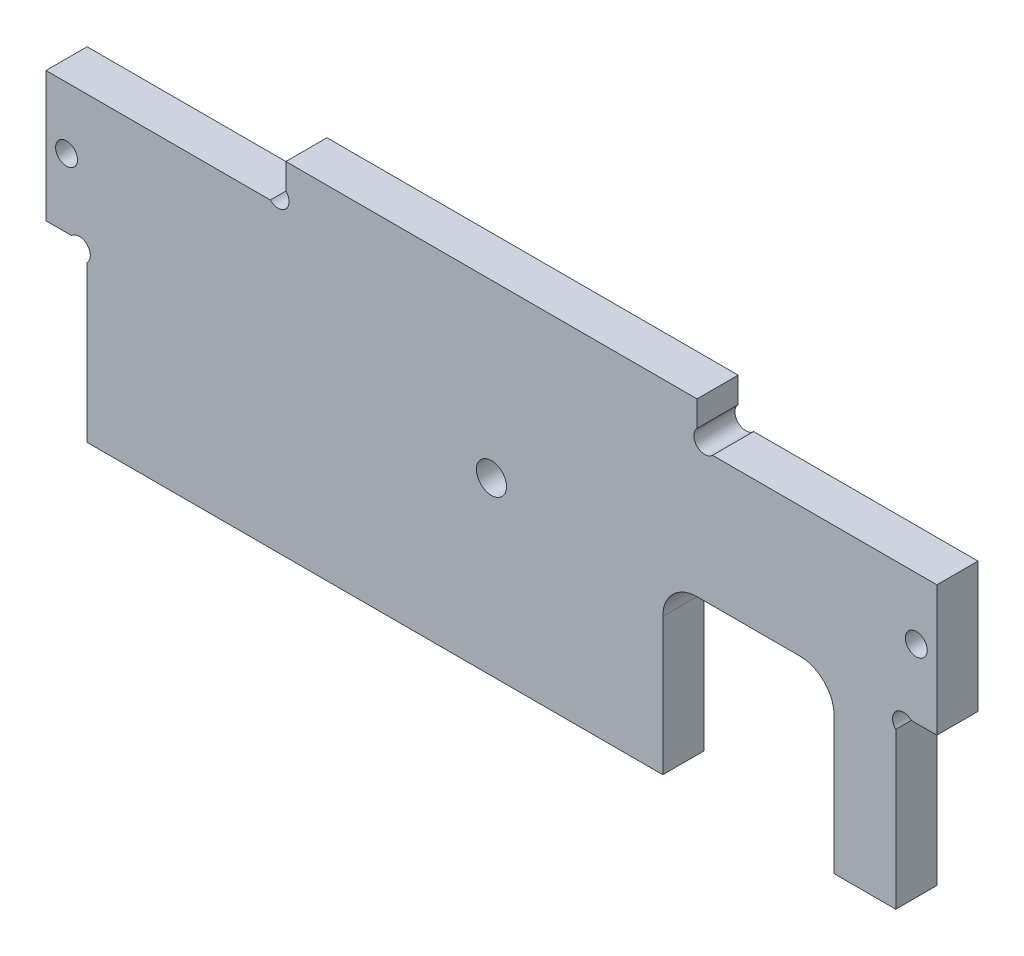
from build123d import *

# Parameters (mm, degrees)
ESQUISSE1_R        = 1.6
ESQUISSE1_R_2      = 2.2
BOSS_EXTRU_1_DEPTH = 6


with BuildPart() as part:
    # Esquisse1 → Boss.-Extru.1 (new body)
    with BuildSketch(Plane.XY):
        with BuildLine():
            Line((30, 46.2627417), (30, 50))
            Line((30, 50), (-30, 50))
            Line((-30, 50), (-30, 46.2627417))
            ThreePointArc((-30, 46.2627417), (-30, 44), (-32.2627417, 44))
            Line((-32.2627417, 44), (-65, 44))
            Line((-65, 44), (-65, 25))
            Line((-65, 25), (-61.2627417, 25))
            ThreePointArc((-61.2627417, 25), (-59, 25), (-59, 22.7372583))
            Line((-59, 22.7372583), (-59, 0))
            Line((-59, 0), (25, 0))
            Line((25, 0), (25, 20))
            ThreePointArc((25, 20), (26.464466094, 23.535533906), (30, 25))
            Line((30, 25), (45, 25))
            ThreePointArc((45, 25), (48.535533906, 23.535533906), (50, 20))
            Line((50, 20), (50, 0))
            Line((50, 0), (59, 0))
            Line((59, 0), (59, 22.7372583))
            ThreePointArc((59, 22.7372583), (59, 25), (61.2627417, 25))
            Line((61.2627417, 25), (65, 25))
            Line((65, 25), (65, 44))
            Line((65, 44), (32.2627417, 44))
            ThreePointArc((32.2627417, 44), (30, 44), (30, 46.2627417))
        make_face()
        with Locations((62, 35)):
            Circle(ESQUISSE1_R, mode=Mode.SUBTRACT)
        with Locations(Location((-62, 35, 0), (0, 0, 180))):
            Circle(ESQUISSE1_R, mode=Mode.SUBTRACT)
        with Locations((0, 25)):
            Circle(ESQUISSE1_R_2, mode=Mode.SUBTRACT)
    extrude(amount=BOSS_EXTRU_1_DEPTH)


solid = part.part
